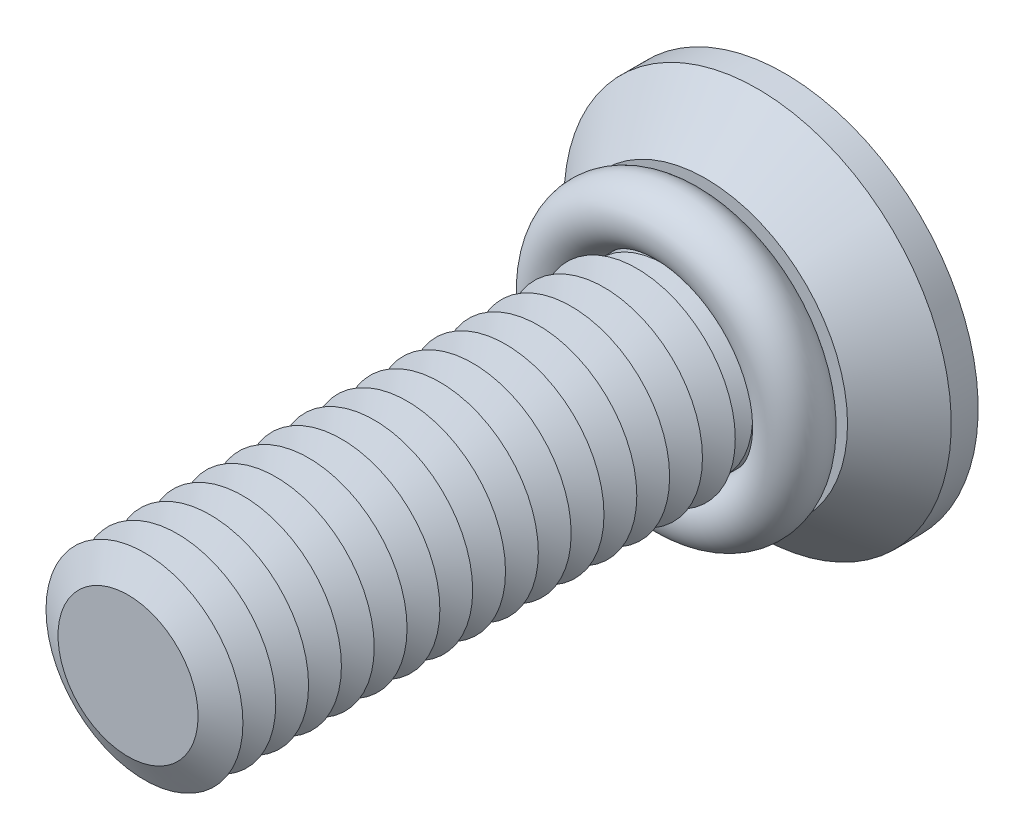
ISO-10303-21;
HEADER;
FILE_DESCRIPTION(('STEP AP214'),'2;1');
FILE_NAME('part.step','',(''),(''),'','','');
FILE_SCHEMA(('AUTOMOTIVE_DESIGN { 1 0 10303 214 1 1 1 1 }'));
ENDSEC;
DATA;
#1=APPLICATION_CONTEXT('core data for automotive mechanical design processes');
#2=APPLICATION_PROTOCOL_DEFINITION('international standard','automotive_design',2000,#1);
#3=PRODUCT_CONTEXT('',#1,'mechanical');
#4=PRODUCT('Part','Part','',(#3));
#5=PRODUCT_RELATED_PRODUCT_CATEGORY('part','',(#4));
#6=PRODUCT_DEFINITION_FORMATION('','',#4);
#7=PRODUCT_DEFINITION_CONTEXT('part definition',#1,'design');
#8=PRODUCT_DEFINITION('design','',#6,#7);
#9=PRODUCT_DEFINITION_SHAPE('','',#8);
#10=(LENGTH_UNIT() NAMED_UNIT(*) SI_UNIT(.MILLI.,.METRE.));
#11=(NAMED_UNIT(*) PLANE_ANGLE_UNIT() SI_UNIT($,.RADIAN.));
#12=(NAMED_UNIT(*) SI_UNIT($,.STERADIAN.) SOLID_ANGLE_UNIT());
#13=UNCERTAINTY_MEASURE_WITH_UNIT(LENGTH_MEASURE(1.E-05),#10,'distance_accuracy_value','');
#14=(GEOMETRIC_REPRESENTATION_CONTEXT(3) GLOBAL_UNCERTAINTY_ASSIGNED_CONTEXT((#13)) GLOBAL_UNIT_ASSIGNED_CONTEXT((#10,
#11,#12)) REPRESENTATION_CONTEXT('',''));
#15=CARTESIAN_POINT('',(0.,0.,0.));
#16=DIRECTION('',(0.,0.,1.));
#17=DIRECTION('',(1.,0.,0.));
#18=AXIS2_PLACEMENT_3D('',#15,#16,#17);
#19=CARTESIAN_POINT('',(0.,0.,3.30000000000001));
#20=DIRECTION('',(0.,0.,1.));
#21=DIRECTION('',(1.,0.,0.));
#22=AXIS2_PLACEMENT_3D('',#19,#20,#21);
#23=TOROIDAL_SURFACE('',#22,3.6,0.9);
#24=CARTESIAN_POINT('',(0.,3.6,3.30000000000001));
#25=DIRECTION('',(1.,0.,0.));
#26=DIRECTION('',(0.,0.,-1.));
#27=AXIS2_PLACEMENT_3D('',#24,#25,#26);
#28=CIRCLE('',#27,0.9);
#29=CARTESIAN_POINT('',(0.,4.5,3.30000000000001));
#30=VERTEX_POINT('',#29);
#31=EDGE_CURVE('P0_E10',#30,#30,#28,.T.);
#32=CARTESIAN_POINT('',(0.,0.,3.30000000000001));
#33=DIRECTION('',(0.,0.,1.));
#34=DIRECTION('',(1.,0.,0.));
#35=AXIS2_PLACEMENT_3D('',#32,#33,#34);
#36=CIRCLE('',#35,4.5);
#37=EDGE_CURVE('',#30,#30,#36,.T.);
#38=ORIENTED_EDGE('',*,*,#31,.F.);
#39=ORIENTED_EDGE('',*,*,#31,.T.);
#40=ORIENTED_EDGE('',*,*,#37,.T.);
#41=ORIENTED_EDGE('',*,*,#37,.F.);
#42=EDGE_LOOP('',(#38,#40,#39,#41));
#43=FACE_BOUND('',#42,.T.);
#44=ADVANCED_FACE('P0_F14',(#43),#23,.T.);
#45=CLOSED_SHELL('',(#44));
#46=MANIFOLD_SOLID_BREP('P0_B1',#45);
#47=CARTESIAN_POINT('',(0.,0.,15.));
#48=DIRECTION('',(0.,0.,-1.));
#49=DIRECTION('',(-1.,0.,0.));
#50=AXIS2_PLACEMENT_3D('',#47,#48,#49);
#51=CONICAL_SURFACE('',#50,2.13397459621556,1.0471975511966);
#52=CARTESIAN_POINT('',(0.,0.,14.5));
#53=DIRECTION('',(0.,0.,1.));
#54=DIRECTION('',(1.,0.,0.));
#55=AXIS2_PLACEMENT_3D('',#52,#53,#54);
#56=CIRCLE('',#55,3.);
#57=CARTESIAN_POINT('',(3.,0.,14.5));
#58=VERTEX_POINT('',#57);
#59=EDGE_CURVE('P1_E324',#58,#58,#56,.T.);
#60=ORIENTED_EDGE('',*,*,#59,.T.);
#61=EDGE_LOOP('',(#60));
#62=FACE_BOUND('',#61,.T.);
#63=CARTESIAN_POINT('',(0.,0.,15.));
#64=DIRECTION('',(0.,0.,1.));
#65=DIRECTION('',(1.,0.,0.));
#66=AXIS2_PLACEMENT_3D('',#63,#64,#65);
#67=CIRCLE('',#66,2.13397459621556);
#68=CARTESIAN_POINT('',(2.13397459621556,0.,15.));
#69=VERTEX_POINT('',#68);
#70=EDGE_CURVE('P1_E321',#69,#69,#67,.T.);
#71=ORIENTED_EDGE('',*,*,#70,.F.);
#72=EDGE_LOOP('',(#71));
#73=FACE_BOUND('',#72,.T.);
#74=ADVANCED_FACE('P1_F15',(#62,#73),#51,.T.);
#75=CARTESIAN_POINT('',(0.,0.,15.5));
#76=DIRECTION('',(0.,0.,1.));
#77=DIRECTION('',(1.,0.,0.));
#78=AXIS2_PLACEMENT_3D('',#75,#76,#77);
#79=CONICAL_SURFACE('',#78,3.,1.0471975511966);
#80=ORIENTED_EDGE('',*,*,#70,.T.);
#81=EDGE_LOOP('',(#80));
#82=FACE_BOUND('',#81,.T.);
#83=CARTESIAN_POINT('',(0.,0.,15.5));
#84=DIRECTION('',(0.,0.,1.));
#85=DIRECTION('',(1.,0.,0.));
#86=AXIS2_PLACEMENT_3D('',#83,#84,#85);
#87=CIRCLE('',#86,3.);
#88=CARTESIAN_POINT('',(3.,0.,15.5));
#89=VERTEX_POINT('',#88);
#90=EDGE_CURVE('P1_E318',#89,#89,#87,.T.);
#91=ORIENTED_EDGE('',*,*,#90,.F.);
#92=EDGE_LOOP('',(#91));
#93=FACE_BOUND('',#92,.T.);
#94=ADVANCED_FACE('P1_F245',(#82,#93),#79,.T.);
#95=CARTESIAN_POINT('',(0.,0.,20.));
#96=DIRECTION('',(0.,0.,1.));
#97=DIRECTION('',(1.,0.,0.));
#98=AXIS2_PLACEMENT_3D('',#95,#96,#97);
#99=PLANE('',#98);
#100=CARTESIAN_POINT('',(0.,0.,20.));
#101=DIRECTION('',(0.,0.,1.));
#102=DIRECTION('',(1.,0.,0.));
#103=AXIS2_PLACEMENT_3D('',#100,#101,#102);
#104=CIRCLE('',#103,2.13397459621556);
#105=CARTESIAN_POINT('',(2.13397459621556,0.,20.));
#106=VERTEX_POINT('',#105);
#107=EDGE_CURVE('P1_E131',#106,#106,#104,.T.);
#108=ORIENTED_EDGE('',*,*,#107,.T.);
#109=EDGE_LOOP('',(#108));
#110=FACE_BOUND('',#109,.T.);
#111=ADVANCED_FACE('P1_F251',(#110),#99,.T.);
#112=CARTESIAN_POINT('',(0.,0.,20.));
#113=DIRECTION('',(0.,0.,-1.));
#114=DIRECTION('',(-1.,0.,0.));
#115=AXIS2_PLACEMENT_3D('',#112,#113,#114);
#116=CONICAL_SURFACE('',#115,2.13397459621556,1.0471975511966);
#117=CARTESIAN_POINT('',(0.,0.,19.5));
#118=DIRECTION('',(0.,0.,1.));
#119=DIRECTION('',(1.,0.,0.));
#120=AXIS2_PLACEMENT_3D('',#117,#118,#119);
#121=CIRCLE('',#120,3.);
#122=CARTESIAN_POINT('',(3.,0.,19.5));
#123=VERTEX_POINT('',#122);
#124=EDGE_CURVE('P1_E133',#123,#123,#121,.T.);
#125=ORIENTED_EDGE('',*,*,#124,.T.);
#126=EDGE_LOOP('',(#125));
#127=FACE_BOUND('',#126,.T.);
#128=ORIENTED_EDGE('',*,*,#107,.F.);
#129=EDGE_LOOP('',(#128));
#130=FACE_BOUND('',#129,.T.);
#131=ADVANCED_FACE('P1_F196',(#127,#130),#116,.T.);
#132=CARTESIAN_POINT('',(0.,0.,19.5));
#133=DIRECTION('',(0.,0.,1.));
#134=DIRECTION('',(1.,0.,0.));
#135=AXIS2_PLACEMENT_3D('',#132,#133,#134);
#136=CONICAL_SURFACE('',#135,3.,1.0471975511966);
#137=CARTESIAN_POINT('',(0.,0.,19.));
#138=DIRECTION('',(0.,0.,1.));
#139=DIRECTION('',(1.,0.,0.));
#140=AXIS2_PLACEMENT_3D('',#137,#138,#139);
#141=CIRCLE('',#140,2.13397459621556);
#142=CARTESIAN_POINT('',(2.13397459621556,0.,19.));
#143=VERTEX_POINT('',#142);
#144=EDGE_CURVE('P1_E297',#143,#143,#141,.T.);
#145=ORIENTED_EDGE('',*,*,#144,.T.);
#146=EDGE_LOOP('',(#145));
#147=FACE_BOUND('',#146,.T.);
#148=ORIENTED_EDGE('',*,*,#124,.F.);
#149=EDGE_LOOP('',(#148));
#150=FACE_BOUND('',#149,.T.);
#151=ADVANCED_FACE('P1_F284',(#147,#150),#136,.T.);
#152=CARTESIAN_POINT('',(0.,0.,19.));
#153=DIRECTION('',(0.,0.,-1.));
#154=DIRECTION('',(-1.,0.,0.));
#155=AXIS2_PLACEMENT_3D('',#152,#153,#154);
#156=CONICAL_SURFACE('',#155,2.13397459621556,1.0471975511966);
#157=CARTESIAN_POINT('',(0.,0.,18.5));
#158=DIRECTION('',(0.,0.,1.));
#159=DIRECTION('',(1.,0.,0.));
#160=AXIS2_PLACEMENT_3D('',#157,#158,#159);
#161=CIRCLE('',#160,3.);
#162=CARTESIAN_POINT('',(3.,0.,18.5));
#163=VERTEX_POINT('',#162);
#164=EDGE_CURVE('P1_E294',#163,#163,#161,.T.);
#165=ORIENTED_EDGE('',*,*,#164,.T.);
#166=EDGE_LOOP('',(#165));
#167=FACE_BOUND('',#166,.T.);
#168=ORIENTED_EDGE('',*,*,#144,.F.);
#169=EDGE_LOOP('',(#168));
#170=FACE_BOUND('',#169,.T.);
#171=ADVANCED_FACE('P1_F279',(#167,#170),#156,.T.);
#172=CARTESIAN_POINT('',(0.,0.,18.5));
#173=DIRECTION('',(0.,0.,1.));
#174=DIRECTION('',(1.,0.,0.));
#175=AXIS2_PLACEMENT_3D('',#172,#173,#174);
#176=CONICAL_SURFACE('',#175,3.,1.0471975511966);
#177=CARTESIAN_POINT('',(0.,0.,18.));
#178=DIRECTION('',(0.,0.,1.));
#179=DIRECTION('',(1.,0.,0.));
#180=AXIS2_PLACEMENT_3D('',#177,#178,#179);
#181=CIRCLE('',#180,2.13397459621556);
#182=CARTESIAN_POINT('',(2.13397459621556,0.,18.));
#183=VERTEX_POINT('',#182);
#184=EDGE_CURVE('P1_E301',#183,#183,#181,.T.);
#185=ORIENTED_EDGE('',*,*,#184,.T.);
#186=EDGE_LOOP('',(#185));
#187=FACE_BOUND('',#186,.T.);
#188=ORIENTED_EDGE('',*,*,#164,.F.);
#189=EDGE_LOOP('',(#188));
#190=FACE_BOUND('',#189,.T.);
#191=ADVANCED_FACE('P1_F276',(#187,#190),#176,.T.);
#192=CARTESIAN_POINT('',(0.,0.,18.));
#193=DIRECTION('',(0.,0.,-1.));
#194=DIRECTION('',(-1.,0.,0.));
#195=AXIS2_PLACEMENT_3D('',#192,#193,#194);
#196=CONICAL_SURFACE('',#195,2.13397459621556,1.0471975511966);
#197=CARTESIAN_POINT('',(0.,0.,17.5));
#198=DIRECTION('',(0.,0.,1.));
#199=DIRECTION('',(1.,0.,0.));
#200=AXIS2_PLACEMENT_3D('',#197,#198,#199);
#201=CIRCLE('',#200,3.);
#202=CARTESIAN_POINT('',(3.,0.,17.5));
#203=VERTEX_POINT('',#202);
#204=EDGE_CURVE('P1_E306',#203,#203,#201,.T.);
#205=ORIENTED_EDGE('',*,*,#204,.T.);
#206=EDGE_LOOP('',(#205));
#207=FACE_BOUND('',#206,.T.);
#208=ORIENTED_EDGE('',*,*,#184,.F.);
#209=EDGE_LOOP('',(#208));
#210=FACE_BOUND('',#209,.T.);
#211=ADVANCED_FACE('P1_F271',(#207,#210),#196,.T.);
#212=CARTESIAN_POINT('',(0.,0.,17.5));
#213=DIRECTION('',(0.,0.,1.));
#214=DIRECTION('',(1.,0.,0.));
#215=AXIS2_PLACEMENT_3D('',#212,#213,#214);
#216=CONICAL_SURFACE('',#215,3.,1.0471975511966);
#217=CARTESIAN_POINT('',(0.,0.,17.));
#218=DIRECTION('',(0.,0.,1.));
#219=DIRECTION('',(1.,0.,0.));
#220=AXIS2_PLACEMENT_3D('',#217,#218,#219);
#221=CIRCLE('',#220,2.13397459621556);
#222=CARTESIAN_POINT('',(2.13397459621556,0.,17.));
#223=VERTEX_POINT('',#222);
#224=EDGE_CURVE('P1_E309',#223,#223,#221,.T.);
#225=ORIENTED_EDGE('',*,*,#224,.T.);
#226=EDGE_LOOP('',(#225));
#227=FACE_BOUND('',#226,.T.);
#228=ORIENTED_EDGE('',*,*,#204,.F.);
#229=EDGE_LOOP('',(#228));
#230=FACE_BOUND('',#229,.T.);
#231=ADVANCED_FACE('P1_F268',(#227,#230),#216,.T.);
#232=CARTESIAN_POINT('',(0.,0.,17.));
#233=DIRECTION('',(0.,0.,-1.));
#234=DIRECTION('',(-1.,0.,0.));
#235=AXIS2_PLACEMENT_3D('',#232,#233,#234);
#236=CONICAL_SURFACE('',#235,2.13397459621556,1.0471975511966);
#237=CARTESIAN_POINT('',(0.,0.,16.5));
#238=DIRECTION('',(0.,0.,1.));
#239=DIRECTION('',(1.,0.,0.));
#240=AXIS2_PLACEMENT_3D('',#237,#238,#239);
#241=CIRCLE('',#240,3.);
#242=CARTESIAN_POINT('',(3.,0.,16.5));
#243=VERTEX_POINT('',#242);
#244=EDGE_CURVE('P1_E312',#243,#243,#241,.T.);
#245=ORIENTED_EDGE('',*,*,#244,.T.);
#246=EDGE_LOOP('',(#245));
#247=FACE_BOUND('',#246,.T.);
#248=ORIENTED_EDGE('',*,*,#224,.F.);
#249=EDGE_LOOP('',(#248));
#250=FACE_BOUND('',#249,.T.);
#251=ADVANCED_FACE('P1_F262',(#247,#250),#236,.T.);
#252=CARTESIAN_POINT('',(0.,0.,16.5));
#253=DIRECTION('',(0.,0.,1.));
#254=DIRECTION('',(1.,0.,0.));
#255=AXIS2_PLACEMENT_3D('',#252,#253,#254);
#256=CONICAL_SURFACE('',#255,3.,1.0471975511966);
#257=CARTESIAN_POINT('',(0.,0.,16.));
#258=DIRECTION('',(0.,0.,1.));
#259=DIRECTION('',(1.,0.,0.));
#260=AXIS2_PLACEMENT_3D('',#257,#258,#259);
#261=CIRCLE('',#260,2.13397459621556);
#262=CARTESIAN_POINT('',(2.13397459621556,0.,16.));
#263=VERTEX_POINT('',#262);
#264=EDGE_CURVE('P1_E315',#263,#263,#261,.T.);
#265=ORIENTED_EDGE('',*,*,#264,.T.);
#266=EDGE_LOOP('',(#265));
#267=FACE_BOUND('',#266,.T.);
#268=ORIENTED_EDGE('',*,*,#244,.F.);
#269=EDGE_LOOP('',(#268));
#270=FACE_BOUND('',#269,.T.);
#271=ADVANCED_FACE('P1_F258',(#267,#270),#256,.T.);
#272=CARTESIAN_POINT('',(0.,0.,16.));
#273=DIRECTION('',(0.,0.,-1.));
#274=DIRECTION('',(-1.,0.,0.));
#275=AXIS2_PLACEMENT_3D('',#272,#273,#274);
#276=CONICAL_SURFACE('',#275,2.13397459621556,1.0471975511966);
#277=ORIENTED_EDGE('',*,*,#90,.T.);
#278=EDGE_LOOP('',(#277));
#279=FACE_BOUND('',#278,.T.);
#280=ORIENTED_EDGE('',*,*,#264,.F.);
#281=EDGE_LOOP('',(#280));
#282=FACE_BOUND('',#281,.T.);
#283=ADVANCED_FACE('P1_F261',(#279,#282),#276,.T.);
#284=CARTESIAN_POINT('',(0.,0.,14.));
#285=DIRECTION('',(0.,0.,-1.));
#286=DIRECTION('',(-1.,0.,0.));
#287=AXIS2_PLACEMENT_3D('',#284,#285,#286);
#288=CONICAL_SURFACE('',#287,2.13397459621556,1.0471975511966);
#289=CARTESIAN_POINT('',(0.,0.,13.5));
#290=DIRECTION('',(0.,0.,1.));
#291=DIRECTION('',(1.,0.,0.));
#292=AXIS2_PLACEMENT_3D('',#289,#290,#291);
#293=CIRCLE('',#292,3.);
#294=CARTESIAN_POINT('',(3.,0.,13.5));
#295=VERTEX_POINT('',#294);
#296=EDGE_CURVE('P1_E329',#295,#295,#293,.T.);
#297=ORIENTED_EDGE('',*,*,#296,.T.);
#298=EDGE_LOOP('',(#297));
#299=FACE_BOUND('',#298,.T.);
#300=CARTESIAN_POINT('',(0.,0.,14.));
#301=DIRECTION('',(0.,0.,1.));
#302=DIRECTION('',(1.,0.,0.));
#303=AXIS2_PLACEMENT_3D('',#300,#301,#302);
#304=CIRCLE('',#303,2.13397459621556);
#305=CARTESIAN_POINT('',(2.13397459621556,0.,14.));
#306=VERTEX_POINT('',#305);
#307=EDGE_CURVE('P1_E326',#306,#306,#304,.T.);
#308=ORIENTED_EDGE('',*,*,#307,.F.);
#309=EDGE_LOOP('',(#308));
#310=FACE_BOUND('',#309,.T.);
#311=ADVANCED_FACE('P1_F266',(#299,#310),#288,.T.);
#312=CARTESIAN_POINT('',(0.,0.,14.5));
#313=DIRECTION('',(0.,0.,1.));
#314=DIRECTION('',(1.,0.,0.));
#315=AXIS2_PLACEMENT_3D('',#312,#313,#314);
#316=CONICAL_SURFACE('',#315,3.,1.0471975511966);
#317=ORIENTED_EDGE('',*,*,#307,.T.);
#318=EDGE_LOOP('',(#317));
#319=FACE_BOUND('',#318,.T.);
#320=ORIENTED_EDGE('',*,*,#59,.F.);
#321=EDGE_LOOP('',(#320));
#322=FACE_BOUND('',#321,.T.);
#323=ADVANCED_FACE('P1_F492',(#319,#322),#316,.T.);
#324=CARTESIAN_POINT('',(0.,0.,13.));
#325=DIRECTION('',(0.,0.,-1.));
#326=DIRECTION('',(-1.,0.,0.));
#327=AXIS2_PLACEMENT_3D('',#324,#325,#326);
#328=CONICAL_SURFACE('',#327,2.13397459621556,1.0471975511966);
#329=CARTESIAN_POINT('',(0.,0.,12.5));
#330=DIRECTION('',(0.,0.,1.));
#331=DIRECTION('',(1.,0.,0.));
#332=AXIS2_PLACEMENT_3D('',#329,#330,#331);
#333=CIRCLE('',#332,3.);
#334=CARTESIAN_POINT('',(3.,0.,12.5));
#335=VERTEX_POINT('',#334);
#336=EDGE_CURVE('P1_E335',#335,#335,#333,.T.);
#337=ORIENTED_EDGE('',*,*,#336,.T.);
#338=EDGE_LOOP('',(#337));
#339=FACE_BOUND('',#338,.T.);
#340=CARTESIAN_POINT('',(0.,0.,13.));
#341=DIRECTION('',(0.,0.,1.));
#342=DIRECTION('',(1.,0.,0.));
#343=AXIS2_PLACEMENT_3D('',#340,#341,#342);
#344=CIRCLE('',#343,2.13397459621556);
#345=CARTESIAN_POINT('',(2.13397459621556,0.,13.));
#346=VERTEX_POINT('',#345);
#347=EDGE_CURVE('P1_E332',#346,#346,#344,.T.);
#348=ORIENTED_EDGE('',*,*,#347,.F.);
#349=EDGE_LOOP('',(#348));
#350=FACE_BOUND('',#349,.T.);
#351=ADVANCED_FACE('P1_F502',(#339,#350),#328,.T.);
#352=CARTESIAN_POINT('',(0.,0.,13.5));
#353=DIRECTION('',(0.,0.,1.));
#354=DIRECTION('',(1.,0.,0.));
#355=AXIS2_PLACEMENT_3D('',#352,#353,#354);
#356=CONICAL_SURFACE('',#355,3.,1.0471975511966);
#357=ORIENTED_EDGE('',*,*,#347,.T.);
#358=EDGE_LOOP('',(#357));
#359=FACE_BOUND('',#358,.T.);
#360=ORIENTED_EDGE('',*,*,#296,.F.);
#361=EDGE_LOOP('',(#360));
#362=FACE_BOUND('',#361,.T.);
#363=ADVANCED_FACE('P1_F512',(#359,#362),#356,.T.);
#364=CARTESIAN_POINT('',(0.,0.,12.));
#365=DIRECTION('',(0.,0.,-1.));
#366=DIRECTION('',(-1.,0.,0.));
#367=AXIS2_PLACEMENT_3D('',#364,#365,#366);
#368=CONICAL_SURFACE('',#367,2.13397459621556,1.0471975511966);
#369=CARTESIAN_POINT('',(0.,0.,11.5));
#370=DIRECTION('',(0.,0.,1.));
#371=DIRECTION('',(1.,0.,0.));
#372=AXIS2_PLACEMENT_3D('',#369,#370,#371);
#373=CIRCLE('',#372,3.);
#374=CARTESIAN_POINT('',(3.,0.,11.5));
#375=VERTEX_POINT('',#374);
#376=EDGE_CURVE('P1_E341',#375,#375,#373,.T.);
#377=ORIENTED_EDGE('',*,*,#376,.T.);
#378=EDGE_LOOP('',(#377));
#379=FACE_BOUND('',#378,.T.);
#380=CARTESIAN_POINT('',(0.,0.,12.));
#381=DIRECTION('',(0.,0.,1.));
#382=DIRECTION('',(1.,0.,0.));
#383=AXIS2_PLACEMENT_3D('',#380,#381,#382);
#384=CIRCLE('',#383,2.13397459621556);
#385=CARTESIAN_POINT('',(2.13397459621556,0.,12.));
#386=VERTEX_POINT('',#385);
#387=EDGE_CURVE('P1_E338',#386,#386,#384,.T.);
#388=ORIENTED_EDGE('',*,*,#387,.F.);
#389=EDGE_LOOP('',(#388));
#390=FACE_BOUND('',#389,.T.);
#391=ADVANCED_FACE('P1_F522',(#379,#390),#368,.T.);
#392=CARTESIAN_POINT('',(0.,0.,12.5));
#393=DIRECTION('',(0.,0.,1.));
#394=DIRECTION('',(1.,0.,0.));
#395=AXIS2_PLACEMENT_3D('',#392,#393,#394);
#396=CONICAL_SURFACE('',#395,3.,1.0471975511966);
#397=ORIENTED_EDGE('',*,*,#387,.T.);
#398=EDGE_LOOP('',(#397));
#399=FACE_BOUND('',#398,.T.);
#400=ORIENTED_EDGE('',*,*,#336,.F.);
#401=EDGE_LOOP('',(#400));
#402=FACE_BOUND('',#401,.T.);
#403=ADVANCED_FACE('P1_F532',(#399,#402),#396,.T.);
#404=CARTESIAN_POINT('',(0.,0.,11.));
#405=DIRECTION('',(0.,0.,-1.));
#406=DIRECTION('',(-1.,0.,0.));
#407=AXIS2_PLACEMENT_3D('',#404,#405,#406);
#408=CONICAL_SURFACE('',#407,2.13397459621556,1.0471975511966);
#409=CARTESIAN_POINT('',(0.,0.,10.5));
#410=DIRECTION('',(0.,0.,1.));
#411=DIRECTION('',(1.,0.,0.));
#412=AXIS2_PLACEMENT_3D('',#409,#410,#411);
#413=CIRCLE('',#412,3.);
#414=CARTESIAN_POINT('',(3.,0.,10.5));
#415=VERTEX_POINT('',#414);
#416=EDGE_CURVE('P1_E347',#415,#415,#413,.T.);
#417=ORIENTED_EDGE('',*,*,#416,.T.);
#418=EDGE_LOOP('',(#417));
#419=FACE_BOUND('',#418,.T.);
#420=CARTESIAN_POINT('',(0.,0.,11.));
#421=DIRECTION('',(0.,0.,1.));
#422=DIRECTION('',(1.,0.,0.));
#423=AXIS2_PLACEMENT_3D('',#420,#421,#422);
#424=CIRCLE('',#423,2.13397459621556);
#425=CARTESIAN_POINT('',(2.13397459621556,0.,11.));
#426=VERTEX_POINT('',#425);
#427=EDGE_CURVE('P1_E344',#426,#426,#424,.T.);
#428=ORIENTED_EDGE('',*,*,#427,.F.);
#429=EDGE_LOOP('',(#428));
#430=FACE_BOUND('',#429,.T.);
#431=ADVANCED_FACE('P1_F542',(#419,#430),#408,.T.);
#432=CARTESIAN_POINT('',(0.,0.,11.5));
#433=DIRECTION('',(0.,0.,1.));
#434=DIRECTION('',(1.,0.,0.));
#435=AXIS2_PLACEMENT_3D('',#432,#433,#434);
#436=CONICAL_SURFACE('',#435,3.,1.0471975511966);
#437=ORIENTED_EDGE('',*,*,#427,.T.);
#438=EDGE_LOOP('',(#437));
#439=FACE_BOUND('',#438,.T.);
#440=ORIENTED_EDGE('',*,*,#376,.F.);
#441=EDGE_LOOP('',(#440));
#442=FACE_BOUND('',#441,.T.);
#443=ADVANCED_FACE('P1_F552',(#439,#442),#436,.T.);
#444=CARTESIAN_POINT('',(0.,0.,10.));
#445=DIRECTION('',(0.,0.,-1.));
#446=DIRECTION('',(-1.,0.,0.));
#447=AXIS2_PLACEMENT_3D('',#444,#445,#446);
#448=CONICAL_SURFACE('',#447,2.13397459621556,1.0471975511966);
#449=CARTESIAN_POINT('',(0.,0.,9.5));
#450=DIRECTION('',(0.,0.,1.));
#451=DIRECTION('',(1.,0.,0.));
#452=AXIS2_PLACEMENT_3D('',#449,#450,#451);
#453=CIRCLE('',#452,3.);
#454=CARTESIAN_POINT('',(3.,0.,9.5));
#455=VERTEX_POINT('',#454);
#456=EDGE_CURVE('P1_E353',#455,#455,#453,.T.);
#457=ORIENTED_EDGE('',*,*,#456,.T.);
#458=EDGE_LOOP('',(#457));
#459=FACE_BOUND('',#458,.T.);
#460=CARTESIAN_POINT('',(0.,0.,10.));
#461=DIRECTION('',(0.,0.,1.));
#462=DIRECTION('',(1.,0.,0.));
#463=AXIS2_PLACEMENT_3D('',#460,#461,#462);
#464=CIRCLE('',#463,2.13397459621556);
#465=CARTESIAN_POINT('',(2.13397459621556,0.,10.));
#466=VERTEX_POINT('',#465);
#467=EDGE_CURVE('P1_E350',#466,#466,#464,.T.);
#468=ORIENTED_EDGE('',*,*,#467,.F.);
#469=EDGE_LOOP('',(#468));
#470=FACE_BOUND('',#469,.T.);
#471=ADVANCED_FACE('P1_F562',(#459,#470),#448,.T.);
#472=CARTESIAN_POINT('',(0.,0.,10.5));
#473=DIRECTION('',(0.,0.,1.));
#474=DIRECTION('',(1.,0.,0.));
#475=AXIS2_PLACEMENT_3D('',#472,#473,#474);
#476=CONICAL_SURFACE('',#475,3.,1.0471975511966);
#477=ORIENTED_EDGE('',*,*,#467,.T.);
#478=EDGE_LOOP('',(#477));
#479=FACE_BOUND('',#478,.T.);
#480=ORIENTED_EDGE('',*,*,#416,.F.);
#481=EDGE_LOOP('',(#480));
#482=FACE_BOUND('',#481,.T.);
#483=ADVANCED_FACE('P1_F572',(#479,#482),#476,.T.);
#484=CARTESIAN_POINT('',(0.,0.,9.));
#485=DIRECTION('',(0.,0.,-1.));
#486=DIRECTION('',(-1.,0.,0.));
#487=AXIS2_PLACEMENT_3D('',#484,#485,#486);
#488=CONICAL_SURFACE('',#487,2.13397459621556,1.0471975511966);
#489=CARTESIAN_POINT('',(0.,0.,8.5));
#490=DIRECTION('',(0.,0.,1.));
#491=DIRECTION('',(1.,0.,0.));
#492=AXIS2_PLACEMENT_3D('',#489,#490,#491);
#493=CIRCLE('',#492,3.);
#494=CARTESIAN_POINT('',(3.,0.,8.5));
#495=VERTEX_POINT('',#494);
#496=EDGE_CURVE('P1_E359',#495,#495,#493,.T.);
#497=ORIENTED_EDGE('',*,*,#496,.T.);
#498=EDGE_LOOP('',(#497));
#499=FACE_BOUND('',#498,.T.);
#500=CARTESIAN_POINT('',(0.,0.,9.));
#501=DIRECTION('',(0.,0.,1.));
#502=DIRECTION('',(1.,0.,0.));
#503=AXIS2_PLACEMENT_3D('',#500,#501,#502);
#504=CIRCLE('',#503,2.13397459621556);
#505=CARTESIAN_POINT('',(2.13397459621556,0.,9.));
#506=VERTEX_POINT('',#505);
#507=EDGE_CURVE('P1_E356',#506,#506,#504,.T.);
#508=ORIENTED_EDGE('',*,*,#507,.F.);
#509=EDGE_LOOP('',(#508));
#510=FACE_BOUND('',#509,.T.);
#511=ADVANCED_FACE('P1_F582',(#499,#510),#488,.T.);
#512=CARTESIAN_POINT('',(0.,0.,9.5));
#513=DIRECTION('',(0.,0.,1.));
#514=DIRECTION('',(1.,0.,0.));
#515=AXIS2_PLACEMENT_3D('',#512,#513,#514);
#516=CONICAL_SURFACE('',#515,3.,1.0471975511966);
#517=ORIENTED_EDGE('',*,*,#507,.T.);
#518=EDGE_LOOP('',(#517));
#519=FACE_BOUND('',#518,.T.);
#520=ORIENTED_EDGE('',*,*,#456,.F.);
#521=EDGE_LOOP('',(#520));
#522=FACE_BOUND('',#521,.T.);
#523=ADVANCED_FACE('P1_F592',(#519,#522),#516,.T.);
#524=CARTESIAN_POINT('',(0.,0.,8.));
#525=DIRECTION('',(0.,0.,-1.));
#526=DIRECTION('',(-1.,0.,0.));
#527=AXIS2_PLACEMENT_3D('',#524,#525,#526);
#528=CONICAL_SURFACE('',#527,2.13397459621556,1.0471975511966);
#529=CARTESIAN_POINT('',(0.,0.,7.5));
#530=DIRECTION('',(0.,0.,1.));
#531=DIRECTION('',(1.,0.,0.));
#532=AXIS2_PLACEMENT_3D('',#529,#530,#531);
#533=CIRCLE('',#532,3.);
#534=CARTESIAN_POINT('',(3.,0.,7.5));
#535=VERTEX_POINT('',#534);
#536=EDGE_CURVE('P1_E365',#535,#535,#533,.T.);
#537=ORIENTED_EDGE('',*,*,#536,.T.);
#538=EDGE_LOOP('',(#537));
#539=FACE_BOUND('',#538,.T.);
#540=CARTESIAN_POINT('',(0.,0.,8.));
#541=DIRECTION('',(0.,0.,1.));
#542=DIRECTION('',(1.,0.,0.));
#543=AXIS2_PLACEMENT_3D('',#540,#541,#542);
#544=CIRCLE('',#543,2.13397459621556);
#545=CARTESIAN_POINT('',(2.13397459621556,0.,8.));
#546=VERTEX_POINT('',#545);
#547=EDGE_CURVE('P1_E362',#546,#546,#544,.T.);
#548=ORIENTED_EDGE('',*,*,#547,.F.);
#549=EDGE_LOOP('',(#548));
#550=FACE_BOUND('',#549,.T.);
#551=ADVANCED_FACE('P1_F602',(#539,#550),#528,.T.);
#552=CARTESIAN_POINT('',(0.,0.,8.5));
#553=DIRECTION('',(0.,0.,1.));
#554=DIRECTION('',(1.,0.,0.));
#555=AXIS2_PLACEMENT_3D('',#552,#553,#554);
#556=CONICAL_SURFACE('',#555,3.,1.0471975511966);
#557=ORIENTED_EDGE('',*,*,#547,.T.);
#558=EDGE_LOOP('',(#557));
#559=FACE_BOUND('',#558,.T.);
#560=ORIENTED_EDGE('',*,*,#496,.F.);
#561=EDGE_LOOP('',(#560));
#562=FACE_BOUND('',#561,.T.);
#563=ADVANCED_FACE('P1_F612',(#559,#562),#556,.T.);
#564=CARTESIAN_POINT('',(0.,0.,7.));
#565=DIRECTION('',(0.,0.,-1.));
#566=DIRECTION('',(-1.,0.,0.));
#567=AXIS2_PLACEMENT_3D('',#564,#565,#566);
#568=CONICAL_SURFACE('',#567,2.13397459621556,1.0471975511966);
#569=CARTESIAN_POINT('',(0.,0.,6.5));
#570=DIRECTION('',(0.,0.,1.));
#571=DIRECTION('',(1.,0.,0.));
#572=AXIS2_PLACEMENT_3D('',#569,#570,#571);
#573=CIRCLE('',#572,3.);
#574=CARTESIAN_POINT('',(3.,0.,6.5));
#575=VERTEX_POINT('',#574);
#576=EDGE_CURVE('P1_E371',#575,#575,#573,.T.);
#577=ORIENTED_EDGE('',*,*,#576,.T.);
#578=EDGE_LOOP('',(#577));
#579=FACE_BOUND('',#578,.T.);
#580=CARTESIAN_POINT('',(0.,0.,7.));
#581=DIRECTION('',(0.,0.,1.));
#582=DIRECTION('',(1.,0.,0.));
#583=AXIS2_PLACEMENT_3D('',#580,#581,#582);
#584=CIRCLE('',#583,2.13397459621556);
#585=CARTESIAN_POINT('',(2.13397459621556,0.,7.));
#586=VERTEX_POINT('',#585);
#587=EDGE_CURVE('P1_E368',#586,#586,#584,.T.);
#588=ORIENTED_EDGE('',*,*,#587,.F.);
#589=EDGE_LOOP('',(#588));
#590=FACE_BOUND('',#589,.T.);
#591=ADVANCED_FACE('P1_F622',(#579,#590),#568,.T.);
#592=CARTESIAN_POINT('',(0.,0.,7.5));
#593=DIRECTION('',(0.,0.,1.));
#594=DIRECTION('',(1.,0.,0.));
#595=AXIS2_PLACEMENT_3D('',#592,#593,#594);
#596=CONICAL_SURFACE('',#595,3.,1.0471975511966);
#597=ORIENTED_EDGE('',*,*,#587,.T.);
#598=EDGE_LOOP('',(#597));
#599=FACE_BOUND('',#598,.T.);
#600=ORIENTED_EDGE('',*,*,#536,.F.);
#601=EDGE_LOOP('',(#600));
#602=FACE_BOUND('',#601,.T.);
#603=ADVANCED_FACE('P1_F632',(#599,#602),#596,.T.);
#604=CARTESIAN_POINT('',(0.,0.,6.));
#605=DIRECTION('',(0.,0.,-1.));
#606=DIRECTION('',(-1.,0.,0.));
#607=AXIS2_PLACEMENT_3D('',#604,#605,#606);
#608=CONICAL_SURFACE('',#607,2.13397459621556,1.0471975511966);
#609=CARTESIAN_POINT('',(0.,0.,5.5));
#610=DIRECTION('',(0.,0.,1.));
#611=DIRECTION('',(1.,0.,0.));
#612=AXIS2_PLACEMENT_3D('',#609,#610,#611);
#613=CIRCLE('',#612,3.);
#614=CARTESIAN_POINT('',(3.,0.,5.5));
#615=VERTEX_POINT('',#614);
#616=EDGE_CURVE('P1_E377',#615,#615,#613,.T.);
#617=ORIENTED_EDGE('',*,*,#616,.T.);
#618=EDGE_LOOP('',(#617));
#619=FACE_BOUND('',#618,.T.);
#620=CARTESIAN_POINT('',(0.,0.,6.));
#621=DIRECTION('',(0.,0.,1.));
#622=DIRECTION('',(1.,0.,0.));
#623=AXIS2_PLACEMENT_3D('',#620,#621,#622);
#624=CIRCLE('',#623,2.13397459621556);
#625=CARTESIAN_POINT('',(2.13397459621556,0.,6.));
#626=VERTEX_POINT('',#625);
#627=EDGE_CURVE('P1_E374',#626,#626,#624,.T.);
#628=ORIENTED_EDGE('',*,*,#627,.F.);
#629=EDGE_LOOP('',(#628));
#630=FACE_BOUND('',#629,.T.);
#631=ADVANCED_FACE('P1_F642',(#619,#630),#608,.T.);
#632=CARTESIAN_POINT('',(0.,0.,6.5));
#633=DIRECTION('',(0.,0.,1.));
#634=DIRECTION('',(1.,0.,0.));
#635=AXIS2_PLACEMENT_3D('',#632,#633,#634);
#636=CONICAL_SURFACE('',#635,3.,1.0471975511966);
#637=ORIENTED_EDGE('',*,*,#627,.T.);
#638=EDGE_LOOP('',(#637));
#639=FACE_BOUND('',#638,.T.);
#640=ORIENTED_EDGE('',*,*,#576,.F.);
#641=EDGE_LOOP('',(#640));
#642=FACE_BOUND('',#641,.T.);
#643=ADVANCED_FACE('P1_F652',(#639,#642),#636,.T.);
#644=CARTESIAN_POINT('',(0.,0.,5.));
#645=DIRECTION('',(0.,0.,-1.));
#646=DIRECTION('',(-1.,0.,0.));
#647=AXIS2_PLACEMENT_3D('',#644,#645,#646);
#648=CONICAL_SURFACE('',#647,2.13397459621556,1.0471975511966);
#649=CARTESIAN_POINT('',(0.,0.,4.5));
#650=DIRECTION('',(0.,0.,1.));
#651=DIRECTION('',(1.,0.,0.));
#652=AXIS2_PLACEMENT_3D('',#649,#650,#651);
#653=CIRCLE('',#652,3.);
#654=CARTESIAN_POINT('',(3.,0.,4.5));
#655=VERTEX_POINT('',#654);
#656=EDGE_CURVE('P1_E383',#655,#655,#653,.T.);
#657=ORIENTED_EDGE('',*,*,#656,.T.);
#658=EDGE_LOOP('',(#657));
#659=FACE_BOUND('',#658,.T.);
#660=CARTESIAN_POINT('',(0.,0.,5.));
#661=DIRECTION('',(0.,0.,1.));
#662=DIRECTION('',(1.,0.,0.));
#663=AXIS2_PLACEMENT_3D('',#660,#661,#662);
#664=CIRCLE('',#663,2.13397459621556);
#665=CARTESIAN_POINT('',(2.13397459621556,0.,5.));
#666=VERTEX_POINT('',#665);
#667=EDGE_CURVE('P1_E380',#666,#666,#664,.T.);
#668=ORIENTED_EDGE('',*,*,#667,.F.);
#669=EDGE_LOOP('',(#668));
#670=FACE_BOUND('',#669,.T.);
#671=ADVANCED_FACE('P1_F662',(#659,#670),#648,.T.);
#672=CARTESIAN_POINT('',(0.,0.,5.5));
#673=DIRECTION('',(0.,0.,1.));
#674=DIRECTION('',(1.,0.,0.));
#675=AXIS2_PLACEMENT_3D('',#672,#673,#674);
#676=CONICAL_SURFACE('',#675,3.,1.0471975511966);
#677=ORIENTED_EDGE('',*,*,#667,.T.);
#678=EDGE_LOOP('',(#677));
#679=FACE_BOUND('',#678,.T.);
#680=ORIENTED_EDGE('',*,*,#616,.F.);
#681=EDGE_LOOP('',(#680));
#682=FACE_BOUND('',#681,.T.);
#683=ADVANCED_FACE('P1_F396',(#679,#682),#676,.T.);
#684=CARTESIAN_POINT('',(0.,0.,4.));
#685=DIRECTION('',(0.,0.,-1.));
#686=DIRECTION('',(-1.,0.,0.));
#687=AXIS2_PLACEMENT_3D('',#684,#685,#686);
#688=CONICAL_SURFACE('',#687,2.13397459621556,1.0471975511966);
#689=CARTESIAN_POINT('',(0.,0.,4.));
#690=DIRECTION('',(0.,0.,1.));
#691=DIRECTION('',(1.,0.,0.));
#692=AXIS2_PLACEMENT_3D('',#689,#690,#691);
#693=CIRCLE('',#692,2.13397459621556);
#694=CARTESIAN_POINT('',(2.13397459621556,0.,4.));
#695=VERTEX_POINT('',#694);
#696=EDGE_CURVE('P1_E386',#695,#695,#693,.T.);
#697=ORIENTED_EDGE('',*,*,#696,.F.);
#698=EDGE_LOOP('',(#697));
#699=FACE_BOUND('',#698,.T.);
#700=CARTESIAN_POINT('',(0.,0.,3.67320508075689));
#701=DIRECTION('',(0.,0.,-1.));
#702=DIRECTION('',(-1.,0.,0.));
#703=AXIS2_PLACEMENT_3D('',#700,#701,#702);
#704=CIRCLE('',#703,2.7);
#705=CARTESIAN_POINT('',(-2.7,0.,3.67320508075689));
#706=VERTEX_POINT('',#705);
#707=EDGE_CURVE('P1_E19',#706,#706,#704,.F.);
#708=ORIENTED_EDGE('',*,*,#707,.T.);
#709=EDGE_LOOP('',(#708));
#710=FACE_BOUND('',#709,.T.);
#711=ADVANCED_FACE('P1_F393',(#699,#710),#688,.T.);
#712=CARTESIAN_POINT('',(0.,0.,4.5));
#713=DIRECTION('',(0.,0.,1.));
#714=DIRECTION('',(1.,0.,0.));
#715=AXIS2_PLACEMENT_3D('',#712,#713,#714);
#716=CONICAL_SURFACE('',#715,3.,1.0471975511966);
#717=ORIENTED_EDGE('',*,*,#696,.T.);
#718=EDGE_LOOP('',(#717));
#719=FACE_BOUND('',#718,.T.);
#720=ORIENTED_EDGE('',*,*,#656,.F.);
#721=EDGE_LOOP('',(#720));
#722=FACE_BOUND('',#721,.T.);
#723=ADVANCED_FACE('P1_F390',(#719,#722),#716,.T.);
#724=CARTESIAN_POINT('',(0.,0.,2.5));
#725=DIRECTION('',(0.,0.,-1.));
#726=DIRECTION('',(-1.,0.,0.));
#727=AXIS2_PLACEMENT_3D('',#724,#725,#726);
#728=CONICAL_SURFACE('',#727,2.,1.0471975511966);
#729=CARTESIAN_POINT('',(0.,0.,3.65470053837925));
#730=VERTEX_POINT('',#729);
#731=VERTEX_LOOP('',#730);
#732=FACE_BOUND('',#731,.T.);
#733=CARTESIAN_POINT('',(0.,0.,2.5));
#734=DIRECTION('',(0.,0.,-1.));
#735=DIRECTION('',(-1.,0.,0.));
#736=AXIS2_PLACEMENT_3D('',#733,#734,#735);
#737=CIRCLE('',#736,2.);
#738=CARTESIAN_POINT('',(-2.,0.,2.5));
#739=VERTEX_POINT('',#738);
#740=CARTESIAN_POINT('',(-1.,1.73205080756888,2.5));
#741=VERTEX_POINT('',#740);
#742=EDGE_CURVE('P1_E117',#739,#741,#737,.T.);
#743=ORIENTED_EDGE('',*,*,#742,.T.);
#744=CARTESIAN_POINT('',(0.,0.,2.5));
#745=DIRECTION('',(0.,0.,-1.));
#746=DIRECTION('',(-1.,0.,0.));
#747=AXIS2_PLACEMENT_3D('',#744,#745,#746);
#748=CIRCLE('',#747,2.);
#749=CARTESIAN_POINT('',(1.,1.73205080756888,2.5));
#750=VERTEX_POINT('',#749);
#751=EDGE_CURVE('P1_E24',#741,#750,#748,.T.);
#752=ORIENTED_EDGE('',*,*,#751,.T.);
#753=CARTESIAN_POINT('',(2.,0.,2.5));
#754=VERTEX_POINT('',#753);
#755=EDGE_CURVE('P1_E895',#750,#754,#748,.T.);
#756=ORIENTED_EDGE('',*,*,#755,.T.);
#757=CARTESIAN_POINT('',(1.,-1.73205080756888,2.5));
#758=VERTEX_POINT('',#757);
#759=EDGE_CURVE('P1_E888',#754,#758,#748,.T.);
#760=ORIENTED_EDGE('',*,*,#759,.T.);
#761=CARTESIAN_POINT('',(-0.999999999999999,-1.73205080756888,2.5));
#762=VERTEX_POINT('',#761);
#763=EDGE_CURVE('P1_E182',#758,#762,#748,.T.);
#764=ORIENTED_EDGE('',*,*,#763,.T.);
#765=EDGE_CURVE('P1_E179',#762,#739,#748,.T.);
#766=ORIENTED_EDGE('',*,*,#765,.T.);
#767=EDGE_LOOP('',(#743,#752,#756,#760,#764,#766));
#768=FACE_BOUND('',#767,.T.);
#769=ADVANCED_FACE('P1_F198',(#732,#768),#728,.F.);
#770=CARTESIAN_POINT('',(0.,0.,2.5));
#771=DIRECTION('',(0.,0.,-1.));
#772=DIRECTION('',(-1.,0.,0.));
#773=AXIS2_PLACEMENT_3D('',#770,#771,#772);
#774=PLANE('',#773);
#775=ORIENTED_EDGE('',*,*,#763,.F.);
#776=DIRECTION('',(-0.866025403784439,-0.5,0.));
#777=VECTOR('',#776,1.);
#778=CARTESIAN_POINT('',(2.,-1.15470053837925,2.5));
#779=LINE('',#778,#777);
#780=CARTESIAN_POINT('',(0.,-2.3094010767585,2.5));
#781=VERTEX_POINT('',#780);
#782=EDGE_CURVE('P1_E904',#758,#781,#779,.T.);
#783=ORIENTED_EDGE('',*,*,#782,.T.);
#784=DIRECTION('',(-0.866025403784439,0.5,0.));
#785=VECTOR('',#784,1.);
#786=CARTESIAN_POINT('',(0.,-2.3094010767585,2.5));
#787=LINE('',#786,#785);
#788=EDGE_CURVE('P1_E911',#781,#762,#787,.T.);
#789=ORIENTED_EDGE('',*,*,#788,.T.);
#790=EDGE_LOOP('',(#775,#783,#789));
#791=FACE_BOUND('',#790,.T.);
#792=ADVANCED_FACE('P1_F704',(#791),#774,.T.);
#793=ORIENTED_EDGE('',*,*,#765,.F.);
#794=CARTESIAN_POINT('',(-2.,-1.15470053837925,2.5));
#795=VERTEX_POINT('',#794);
#796=EDGE_CURVE('P1_E914',#762,#795,#787,.T.);
#797=ORIENTED_EDGE('',*,*,#796,.T.);
#798=DIRECTION('',(0.,1.,0.));
#799=VECTOR('',#798,1.);
#800=CARTESIAN_POINT('',(-2.,-1.15470053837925,2.5));
#801=LINE('',#800,#799);
#802=EDGE_CURVE('P1_E123',#795,#739,#801,.T.);
#803=ORIENTED_EDGE('',*,*,#802,.T.);
#804=EDGE_LOOP('',(#793,#797,#803));
#805=FACE_BOUND('',#804,.T.);
#806=ADVANCED_FACE('P1_F231',(#805),#774,.T.);
#807=ORIENTED_EDGE('',*,*,#742,.F.);
#808=CARTESIAN_POINT('',(-2.,1.15470053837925,2.5));
#809=VERTEX_POINT('',#808);
#810=EDGE_CURVE('P1_E916',#739,#809,#801,.T.);
#811=ORIENTED_EDGE('',*,*,#810,.T.);
#812=DIRECTION('',(0.866025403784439,0.5,0.));
#813=VECTOR('',#812,1.);
#814=CARTESIAN_POINT('',(-2.,1.15470053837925,2.5));
#815=LINE('',#814,#813);
#816=EDGE_CURVE('P1_E919',#809,#741,#815,.T.);
#817=ORIENTED_EDGE('',*,*,#816,.T.);
#818=EDGE_LOOP('',(#807,#811,#817));
#819=FACE_BOUND('',#818,.T.);
#820=ADVANCED_FACE('P1_F721',(#819),#774,.T.);
#821=ORIENTED_EDGE('',*,*,#751,.F.);
#822=CARTESIAN_POINT('',(0.,2.3094010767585,2.5));
#823=VERTEX_POINT('',#822);
#824=EDGE_CURVE('P1_E918',#741,#823,#815,.T.);
#825=ORIENTED_EDGE('',*,*,#824,.T.);
#826=DIRECTION('',(0.866025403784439,-0.5,0.));
#827=VECTOR('',#826,1.);
#828=CARTESIAN_POINT('',(0.,2.3094010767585,2.5));
#829=LINE('',#828,#827);
#830=EDGE_CURVE('P1_E161',#823,#750,#829,.T.);
#831=ORIENTED_EDGE('',*,*,#830,.T.);
#832=EDGE_LOOP('',(#821,#825,#831));
#833=FACE_BOUND('',#832,.T.);
#834=ADVANCED_FACE('P1_F730',(#833),#774,.T.);
#835=ORIENTED_EDGE('',*,*,#755,.F.);
#836=CARTESIAN_POINT('',(2.,1.15470053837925,2.5));
#837=VERTEX_POINT('',#836);
#838=EDGE_CURVE('P1_E903',#750,#837,#829,.T.);
#839=ORIENTED_EDGE('',*,*,#838,.T.);
#840=DIRECTION('',(0.,-1.,0.));
#841=VECTOR('',#840,1.);
#842=CARTESIAN_POINT('',(2.,1.15470053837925,2.5));
#843=LINE('',#842,#841);
#844=EDGE_CURVE('P1_E898',#837,#754,#843,.T.);
#845=ORIENTED_EDGE('',*,*,#844,.T.);
#846=EDGE_LOOP('',(#835,#839,#845));
#847=FACE_BOUND('',#846,.T.);
#848=ADVANCED_FACE('P1_F739',(#847),#774,.T.);
#849=ORIENTED_EDGE('',*,*,#759,.F.);
#850=CARTESIAN_POINT('',(2.,-1.15470053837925,2.5));
#851=VERTEX_POINT('',#850);
#852=EDGE_CURVE('P1_E890',#754,#851,#843,.T.);
#853=ORIENTED_EDGE('',*,*,#852,.T.);
#854=EDGE_CURVE('P1_E125',#851,#758,#779,.T.);
#855=ORIENTED_EDGE('',*,*,#854,.T.);
#856=EDGE_LOOP('',(#849,#853,#855));
#857=FACE_BOUND('',#856,.T.);
#858=ADVANCED_FACE('P1_F229',(#857),#774,.T.);
#859=CARTESIAN_POINT('',(2.,-1.15470053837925,2.5));
#860=DIRECTION('',(0.5,-0.866025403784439,0.));
#861=DIRECTION('',(0.866025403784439,0.5,0.));
#862=AXIS2_PLACEMENT_3D('',#859,#860,#861);
#863=PLANE('',#862);
#864=DIRECTION('',(0.,0.,-1.));
#865=VECTOR('',#864,1.);
#866=CARTESIAN_POINT('',(2.,-1.15470053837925,2.5));
#867=LINE('',#866,#865);
#868=CARTESIAN_POINT('',(2.,-1.15470053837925,0.));
#869=VERTEX_POINT('',#868);
#870=EDGE_CURVE('P1_E164',#851,#869,#867,.T.);
#871=ORIENTED_EDGE('',*,*,#870,.T.);
#872=CARTESIAN_POINT('',(2.0002,-1.15458506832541,-3.09424280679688E-05));
#873=CARTESIAN_POINT('',(1.91712847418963,-1.20254643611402,0.0128270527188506));
#874=CARTESIAN_POINT('',(1.83390630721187,-1.25059477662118,0.0245000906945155));
#875=CARTESIAN_POINT('',(1.66716800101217,-1.34686118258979,0.0450086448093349));
#876=CARTESIAN_POINT('',(1.58365175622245,-1.39507930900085,0.0538430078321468));
#877=CARTESIAN_POINT('',(1.41683177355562,-1.49139287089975,0.0681583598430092));
#878=CARTESIAN_POINT('',(1.33352916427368,-1.53948765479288,0.0736564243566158));
#879=CARTESIAN_POINT('',(1.1668176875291,-1.63573857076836,0.0810287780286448));
#880=CARTESIAN_POINT('',(1.08340884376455,-1.68389468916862,0.0829037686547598));
#881=CARTESIAN_POINT('',(0.916591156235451,-1.78020692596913,0.0829037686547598));
#882=CARTESIAN_POINT('',(0.833182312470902,-1.82836304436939,0.0810287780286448));
#883=CARTESIAN_POINT('',(0.666470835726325,-1.92461396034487,0.0736564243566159));
#884=CARTESIAN_POINT('',(0.583168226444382,-1.972708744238,0.0681583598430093));
#885=CARTESIAN_POINT('',(0.416348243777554,-2.0690223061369,0.0538430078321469));
#886=CARTESIAN_POINT('',(0.332831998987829,-2.11724043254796,0.045008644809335));
#887=CARTESIAN_POINT('',(0.16609369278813,-2.21350683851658,0.0245000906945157));
#888=CARTESIAN_POINT('',(0.0828715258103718,-2.26155517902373,0.0128270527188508));
#889=CARTESIAN_POINT('',(-0.000199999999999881,-2.30951654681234,-3.09424280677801E-05));
#890=B_SPLINE_CURVE_WITH_KNOTS('',3,(#872,#873,#874,#875,#876,#877,#878,#879,#880,#881,#882,
#883,#884,#885,#886,#887,#888,#889),.UNSPECIFIED.,.F.,.F.,(4,2,2,2,2,2,2,2,4),(0.,
0.29035724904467,0.580832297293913,0.869807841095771,1.15872743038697,1.44764701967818,
1.73662256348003,2.02709761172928,2.31745486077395),.UNSPECIFIED.);
#891=CARTESIAN_POINT('',(0.,-2.3094010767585,0.));
#892=VERTEX_POINT('',#891);
#893=EDGE_CURVE('P1_E118',#869,#892,#890,.T.);
#894=ORIENTED_EDGE('',*,*,#893,.T.);
#895=DIRECTION('',(0.,0.,-1.));
#896=VECTOR('',#895,1.);
#897=CARTESIAN_POINT('',(0.,-2.3094010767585,2.5));
#898=LINE('',#897,#896);
#899=EDGE_CURVE('P1_E116',#781,#892,#898,.T.);
#900=ORIENTED_EDGE('',*,*,#899,.F.);
#901=ORIENTED_EDGE('',*,*,#782,.F.);
#902=ORIENTED_EDGE('',*,*,#854,.F.);
#903=EDGE_LOOP('',(#871,#894,#900,#901,#902));
#904=FACE_BOUND('',#903,.T.);
#905=ADVANCED_FACE('P1_F226',(#904),#863,.F.);
#906=CARTESIAN_POINT('',(0.,-2.3094010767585,2.5));
#907=DIRECTION('',(-0.5,-0.866025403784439,0.));
#908=DIRECTION('',(0.866025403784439,-0.5,0.));
#909=AXIS2_PLACEMENT_3D('',#906,#907,#908);
#910=PLANE('',#909);
#911=ORIENTED_EDGE('',*,*,#899,.T.);
#912=CARTESIAN_POINT('',(0.00019999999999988,-2.30951654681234,-3.09424280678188E-05));
#913=CARTESIAN_POINT('',(-0.0828715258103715,-2.26155517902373,0.0128270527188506));
#914=CARTESIAN_POINT('',(-0.166093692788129,-2.21350683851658,0.0245000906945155));
#915=CARTESIAN_POINT('',(-0.332831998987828,-2.11724043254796,0.0450086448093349));
#916=CARTESIAN_POINT('',(-0.416348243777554,-2.0690223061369,0.0538430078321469));
#917=CARTESIAN_POINT('',(-0.583168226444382,-1.972708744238,0.0681583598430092));
#918=CARTESIAN_POINT('',(-0.666470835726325,-1.92461396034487,0.0736564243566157));
#919=CARTESIAN_POINT('',(-0.833182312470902,-1.82836304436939,0.0810287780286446));
#920=CARTESIAN_POINT('',(-0.916591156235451,-1.78020692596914,0.0829037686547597));
#921=CARTESIAN_POINT('',(-1.08340884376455,-1.68389468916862,0.0829037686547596));
#922=CARTESIAN_POINT('',(-1.1668176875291,-1.63573857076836,0.0810287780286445));
#923=CARTESIAN_POINT('',(-1.33352916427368,-1.53948765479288,0.0736564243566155));
#924=CARTESIAN_POINT('',(-1.41683177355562,-1.49139287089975,0.068158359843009));
#925=CARTESIAN_POINT('',(-1.58365175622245,-1.39507930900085,0.0538430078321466));
#926=CARTESIAN_POINT('',(-1.66716800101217,-1.3468611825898,0.0450086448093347));
#927=CARTESIAN_POINT('',(-1.83390630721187,-1.25059477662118,0.0245000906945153));
#928=CARTESIAN_POINT('',(-1.91712847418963,-1.20254643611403,0.0128270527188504));
#929=CARTESIAN_POINT('',(-2.0002,-1.15458506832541,-3.09424280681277E-05));
#930=B_SPLINE_CURVE_WITH_KNOTS('',3,(#912,#913,#914,#915,#916,#917,#918,#919,#920,#921,#922,
#923,#924,#925,#926,#927,#928,#929),.UNSPECIFIED.,.F.,.F.,(4,2,2,2,2,2,2,2,4),(0.,
0.29035724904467,0.580832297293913,0.86980784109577,1.15872743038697,1.44764701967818,
1.73662256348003,2.02709761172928,2.31745486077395),.UNSPECIFIED.);
#931=CARTESIAN_POINT('',(-2.,-1.15470053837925,0.));
#932=VERTEX_POINT('',#931);
#933=EDGE_CURVE('P1_E94',#892,#932,#930,.T.);
#934=ORIENTED_EDGE('',*,*,#933,.T.);
#935=DIRECTION('',(0.,0.,-1.));
#936=VECTOR('',#935,1.);
#937=CARTESIAN_POINT('',(-2.,-1.15470053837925,2.5));
#938=LINE('',#937,#936);
#939=EDGE_CURVE('P1_E112',#795,#932,#938,.T.);
#940=ORIENTED_EDGE('',*,*,#939,.F.);
#941=ORIENTED_EDGE('',*,*,#796,.F.);
#942=ORIENTED_EDGE('',*,*,#788,.F.);
#943=EDGE_LOOP('',(#911,#934,#940,#941,#942));
#944=FACE_BOUND('',#943,.T.);
#945=ADVANCED_FACE('P1_F110',(#944),#910,.F.);
#946=CARTESIAN_POINT('',(-2.,-1.15470053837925,2.5));
#947=DIRECTION('',(-1.,0.,0.));
#948=DIRECTION('',(0.,0.,1.));
#949=AXIS2_PLACEMENT_3D('',#946,#947,#948);
#950=PLANE('',#949);
#951=ORIENTED_EDGE('',*,*,#939,.T.);
#952=CARTESIAN_POINT('',(-2.,-3.01440758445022,-0.350516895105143));
#953=CARTESIAN_POINT('',(-2.,-2.92409762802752,-0.330356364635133));
#954=CARTESIAN_POINT('',(-2.,-2.83373054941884,-0.31045254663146));
#955=CARTESIAN_POINT('',(-2.,-2.65285291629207,-0.271288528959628));
#956=CARTESIAN_POINT('',(-2.,-2.562342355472,-0.252028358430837));
#957=CARTESIAN_POINT('',(-2.,-2.29037985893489,-0.195373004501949));
#958=CARTESIAN_POINT('',(-2.,-2.10868043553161,-0.159144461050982));
#959=CARTESIAN_POINT('',(-2.,-1.74597297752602,-0.091716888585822));
#960=CARTESIAN_POINT('',(-2.,-1.56497266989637,-0.0604768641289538));
#961=CARTESIAN_POINT('',(-2.,-1.20186568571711,-0.00513826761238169));
#962=CARTESIAN_POINT('',(-2.,-1.01975924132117,0.0189617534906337));
#963=CARTESIAN_POINT('',(-2.,-0.744747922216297,0.0474098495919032));
#964=CARTESIAN_POINT('',(-2.,-0.652245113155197,0.0556328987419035));
#965=CARTESIAN_POINT('',(-2.,-0.467020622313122,0.0690059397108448));
#966=CARTESIAN_POINT('',(-2.,-0.374298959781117,0.074156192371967));
#967=CARTESIAN_POINT('',(-2.,-0.188764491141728,0.0810845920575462));
#968=CARTESIAN_POINT('',(-2.,-0.0959517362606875,0.0828640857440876));
#969=CARTESIAN_POINT('',(-2.,0.0896753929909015,0.0829421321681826));
#970=CARTESIAN_POINT('',(-2.,0.182489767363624,0.0812406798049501));
#971=CARTESIAN_POINT('',(-2.,0.368369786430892,0.0744510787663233));
#972=CARTESIAN_POINT('',(-2.,0.461434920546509,0.0693492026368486));
#973=CARTESIAN_POINT('',(-2.,0.647346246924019,0.0560433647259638));
#974=CARTESIAN_POINT('',(-2.,0.740192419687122,0.0478391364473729));
#975=CARTESIAN_POINT('',(-2.,1.01841374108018,0.0191822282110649));
#976=CARTESIAN_POINT('',(-2.,1.2033713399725,-0.00531018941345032));
#977=CARTESIAN_POINT('',(-2.,1.57694396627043,-0.0623620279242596));
#978=CARTESIAN_POINT('',(-2.,1.76552771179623,-0.095116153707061));
#979=CARTESIAN_POINT('',(-2.,2.14178491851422,-0.165570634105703));
#980=CARTESIAN_POINT('',(-2.,2.32945822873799,-0.203271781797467));
#981=CARTESIAN_POINT('',(-2.,2.70417911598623,-0.28188312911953));
#982=CARTESIAN_POINT('',(-2.,2.89122649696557,-0.322794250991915));
#983=CARTESIAN_POINT('',(-2.,3.26484478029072,-0.406742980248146));
#984=CARTESIAN_POINT('',(-2.,3.45141567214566,-0.449780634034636));
#985=CARTESIAN_POINT('',(-2.,3.821938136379,-0.536781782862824));
#986=CARTESIAN_POINT('',(-2.,4.00589388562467,-0.580727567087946));
#987=CARTESIAN_POINT('',(-2.,4.37356350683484,-0.669635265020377));
#988=CARTESIAN_POINT('',(-2.,4.55727737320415,-0.714597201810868));
#989=CARTESIAN_POINT('',(-2.,4.9242660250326,-0.805198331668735));
#990=CARTESIAN_POINT('',(-2.,5.10754106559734,-0.85083649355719));
#991=CARTESIAN_POINT('',(-2.,5.47394280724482,-0.942676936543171));
#992=CARTESIAN_POINT('',(-2.,5.65706951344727,-0.988879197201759));
#993=CARTESIAN_POINT('',(-2.,5.84014583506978,-1.03527803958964));
#994=B_SPLINE_CURVE_WITH_KNOTS('',3,(#952,#953,#954,#955,#956,#957,#958,#959,#960,#961,#962,
#963,#964,#965,#966,#967,#968,#969,#970,#971,#972,#973,#974,#975,#976,#977,#978,#979,#980,#981,
#982,#983,#984,#985,#986,#987,#988,#989,#990,#991,#992,#993),.UNSPECIFIED.,.F.,.F.,(4,2,2,2,2,2,
2,2,2,2,2,2,2,2,2,2,2,2,2,2,4),(0.,0.277597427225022,0.555207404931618,1.11099118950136,
1.66194208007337,2.21278108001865,2.49134108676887,2.76987744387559,3.04830249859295,
3.32672796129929,3.60628428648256,3.88586463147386,4.44532615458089,5.01945893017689,
5.59368385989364,6.16807437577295,6.74247743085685,7.30986991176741,7.87727529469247,
8.44388991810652,9.01048407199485),.UNSPECIFIED.);
#995=CARTESIAN_POINT('',(-2.,1.15470053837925,0.));
#996=VERTEX_POINT('',#995);
#997=EDGE_CURVE('P1_E10',#932,#996,#994,.T.);
#998=ORIENTED_EDGE('',*,*,#997,.T.);
#999=DIRECTION('',(0.,0.,-1.));
#1000=VECTOR('',#999,1.);
#1001=CARTESIAN_POINT('',(-2.,1.15470053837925,2.5));
#1002=LINE('',#1001,#1000);
#1003=EDGE_CURVE('P1_E124',#809,#996,#1002,.T.);
#1004=ORIENTED_EDGE('',*,*,#1003,.F.);
#1005=ORIENTED_EDGE('',*,*,#810,.F.);
#1006=ORIENTED_EDGE('',*,*,#802,.F.);
#1007=EDGE_LOOP('',(#951,#998,#1004,#1005,#1006));
#1008=FACE_BOUND('',#1007,.T.);
#1009=ADVANCED_FACE('P1_F120',(#1008),#950,.F.);
#1010=CARTESIAN_POINT('',(-2.,1.15470053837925,2.5));
#1011=DIRECTION('',(-0.5,0.866025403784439,0.));
#1012=DIRECTION('',(-0.866025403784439,-0.5,0.));
#1013=AXIS2_PLACEMENT_3D('',#1010,#1011,#1012);
#1014=PLANE('',#1013);
#1015=ORIENTED_EDGE('',*,*,#1003,.T.);
#1016=CARTESIAN_POINT('',(-2.0002,1.15458506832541,-3.09424280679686E-05));
#1017=CARTESIAN_POINT('',(-1.91712847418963,1.20254643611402,0.0128270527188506));
#1018=CARTESIAN_POINT('',(-1.83390630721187,1.25059477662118,0.0245000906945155));
#1019=CARTESIAN_POINT('',(-1.66716800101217,1.3468611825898,0.0450086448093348));
#1020=CARTESIAN_POINT('',(-1.58365175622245,1.39507930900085,0.0538430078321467));
#1021=CARTESIAN_POINT('',(-1.41683177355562,1.49139287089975,0.0681583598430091));
#1022=CARTESIAN_POINT('',(-1.33352916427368,1.53948765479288,0.0736564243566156));
#1023=CARTESIAN_POINT('',(-1.1668176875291,1.63573857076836,0.0810287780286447));
#1024=CARTESIAN_POINT('',(-1.08340884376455,1.68389468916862,0.0829037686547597));
#1025=CARTESIAN_POINT('',(-0.916591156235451,1.78020692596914,0.0829037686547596));
#1026=CARTESIAN_POINT('',(-0.833182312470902,1.82836304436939,0.0810287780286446));
#1027=CARTESIAN_POINT('',(-0.666470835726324,1.92461396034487,0.0736564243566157));
#1028=CARTESIAN_POINT('',(-0.583168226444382,1.972708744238,0.0681583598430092));
#1029=CARTESIAN_POINT('',(-0.416348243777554,2.0690223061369,0.0538430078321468));
#1030=CARTESIAN_POINT('',(-0.332831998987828,2.11724043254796,0.0450086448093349));
#1031=CARTESIAN_POINT('',(-0.16609369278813,2.21350683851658,0.0245000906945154));
#1032=CARTESIAN_POINT('',(-0.0828715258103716,2.26155517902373,0.0128270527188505));
#1033=CARTESIAN_POINT('',(0.000199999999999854,2.30951654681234,-3.09424280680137E-05));
#1034=B_SPLINE_CURVE_WITH_KNOTS('',3,(#1016,#1017,#1018,#1019,#1020,#1021,#1022,#1023,#1024,
#1025,#1026,#1027,#1028,#1029,#1030,#1031,#1032,#1033),.UNSPECIFIED.,.F.,.F.,(4,2,2,2,2,2,2,2,
4),(0.,0.290357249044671,0.580832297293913,0.86980784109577,1.15872743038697,1.44764701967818,
1.73662256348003,2.02709761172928,2.31745486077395),.UNSPECIFIED.);
#1035=CARTESIAN_POINT('',(0.,2.3094010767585,0.));
#1036=VERTEX_POINT('',#1035);
#1037=EDGE_CURVE('P1_E136',#996,#1036,#1034,.T.);
#1038=ORIENTED_EDGE('',*,*,#1037,.T.);
#1039=DIRECTION('',(0.,0.,-1.));
#1040=VECTOR('',#1039,1.);
#1041=CARTESIAN_POINT('',(0.,2.3094010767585,2.5));
#1042=LINE('',#1041,#1040);
#1043=EDGE_CURVE('P1_E155',#823,#1036,#1042,.T.);
#1044=ORIENTED_EDGE('',*,*,#1043,.F.);
#1045=ORIENTED_EDGE('',*,*,#824,.F.);
#1046=ORIENTED_EDGE('',*,*,#816,.F.);
#1047=EDGE_LOOP('',(#1015,#1038,#1044,#1045,#1046));
#1048=FACE_BOUND('',#1047,.T.);
#1049=ADVANCED_FACE('P1_F153',(#1048),#1014,.F.);
#1050=CARTESIAN_POINT('',(0.,2.3094010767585,2.5));
#1051=DIRECTION('',(0.5,0.866025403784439,0.));
#1052=DIRECTION('',(-0.866025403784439,0.5,0.));
#1053=AXIS2_PLACEMENT_3D('',#1050,#1051,#1052);
#1054=PLANE('',#1053);
#1055=ORIENTED_EDGE('',*,*,#1043,.T.);
#1056=CARTESIAN_POINT('',(-0.000200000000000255,2.30951654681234,-3.09424280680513E-05));
#1057=CARTESIAN_POINT('',(0.0828715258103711,2.26155517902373,0.0128270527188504));
#1058=CARTESIAN_POINT('',(0.166093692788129,2.21350683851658,0.0245000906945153));
#1059=CARTESIAN_POINT('',(0.332831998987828,2.11724043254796,0.0450086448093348));
#1060=CARTESIAN_POINT('',(0.416348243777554,2.0690223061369,0.0538430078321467));
#1061=CARTESIAN_POINT('',(0.583168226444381,1.972708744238,0.0681583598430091));
#1062=CARTESIAN_POINT('',(0.666470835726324,1.92461396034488,0.0736564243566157));
#1063=CARTESIAN_POINT('',(0.833182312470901,1.82836304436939,0.0810287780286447));
#1064=CARTESIAN_POINT('',(0.916591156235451,1.78020692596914,0.0829037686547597));
#1065=CARTESIAN_POINT('',(1.08340884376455,1.68389468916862,0.0829037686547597));
#1066=CARTESIAN_POINT('',(1.1668176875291,1.63573857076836,0.0810287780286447));
#1067=CARTESIAN_POINT('',(1.33352916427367,1.53948765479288,0.0736564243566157));
#1068=CARTESIAN_POINT('',(1.41683177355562,1.49139287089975,0.0681583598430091));
#1069=CARTESIAN_POINT('',(1.58365175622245,1.39507930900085,0.0538430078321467));
#1070=CARTESIAN_POINT('',(1.66716800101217,1.3468611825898,0.0450086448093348));
#1071=CARTESIAN_POINT('',(1.83390630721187,1.25059477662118,0.0245000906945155));
#1072=CARTESIAN_POINT('',(1.91712847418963,1.20254643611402,0.0128270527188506));
#1073=CARTESIAN_POINT('',(2.0002,1.15458506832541,-3.09424280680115E-05));
#1074=B_SPLINE_CURVE_WITH_KNOTS('',3,(#1056,#1057,#1058,#1059,#1060,#1061,#1062,#1063,#1064,
#1065,#1066,#1067,#1068,#1069,#1070,#1071,#1072,#1073),.UNSPECIFIED.,.F.,.F.,(4,2,2,2,2,2,2,2,
4),(0.,0.290357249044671,0.580832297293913,0.869807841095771,1.15872743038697,1.44764701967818,
1.73662256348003,2.02709761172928,2.31745486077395),.UNSPECIFIED.);
#1075=CARTESIAN_POINT('',(2.,1.15470053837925,0.));
#1076=VERTEX_POINT('',#1075);
#1077=EDGE_CURVE('P1_E141',#1036,#1076,#1074,.T.);
#1078=ORIENTED_EDGE('',*,*,#1077,.T.);
#1079=DIRECTION('',(0.,0.,-1.));
#1080=VECTOR('',#1079,1.);
#1081=CARTESIAN_POINT('',(2.,1.15470053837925,2.5));
#1082=LINE('',#1081,#1080);
#1083=EDGE_CURVE('P1_E162',#837,#1076,#1082,.T.);
#1084=ORIENTED_EDGE('',*,*,#1083,.F.);
#1085=ORIENTED_EDGE('',*,*,#838,.F.);
#1086=ORIENTED_EDGE('',*,*,#830,.F.);
#1087=EDGE_LOOP('',(#1055,#1078,#1084,#1085,#1086));
#1088=FACE_BOUND('',#1087,.T.);
#1089=ADVANCED_FACE('P1_F158',(#1088),#1054,.F.);
#1090=CARTESIAN_POINT('',(2.,1.15470053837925,2.5));
#1091=DIRECTION('',(1.,0.,0.));
#1092=DIRECTION('',(0.,0.,-1.));
#1093=AXIS2_PLACEMENT_3D('',#1090,#1091,#1092);
#1094=PLANE('',#1093);
#1095=ORIENTED_EDGE('',*,*,#1083,.T.);
#1096=CARTESIAN_POINT('',(2.,-3.01440758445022,-0.350516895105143));
#1097=CARTESIAN_POINT('',(2.,-2.92409762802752,-0.330356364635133));
#1098=CARTESIAN_POINT('',(2.,-2.83373054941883,-0.31045254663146));
#1099=CARTESIAN_POINT('',(2.,-2.65285291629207,-0.271288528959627));
#1100=CARTESIAN_POINT('',(2.,-2.562342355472,-0.252028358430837));
#1101=CARTESIAN_POINT('',(2.,-2.29037985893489,-0.195373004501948));
#1102=CARTESIAN_POINT('',(2.,-2.10868043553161,-0.159144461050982));
#1103=CARTESIAN_POINT('',(2.,-1.74597297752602,-0.0917168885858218));
#1104=CARTESIAN_POINT('',(2.,-1.56497266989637,-0.0604768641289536));
#1105=CARTESIAN_POINT('',(2.,-1.20186568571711,-0.00513826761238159));
#1106=CARTESIAN_POINT('',(2.,-1.01975924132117,0.0189617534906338));
#1107=CARTESIAN_POINT('',(2.,-0.744747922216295,0.0474098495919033));
#1108=CARTESIAN_POINT('',(2.,-0.652245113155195,0.0556328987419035));
#1109=CARTESIAN_POINT('',(2.,-0.46702062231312,0.0690059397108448));
#1110=CARTESIAN_POINT('',(2.,-0.374298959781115,0.0741561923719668));
#1111=CARTESIAN_POINT('',(2.,-0.188764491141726,0.0810845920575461));
#1112=CARTESIAN_POINT('',(2.,-0.0959517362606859,0.0828640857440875));
#1113=CARTESIAN_POINT('',(2.,0.0896753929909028,0.0829421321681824));
#1114=CARTESIAN_POINT('',(2.,0.182489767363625,0.0812406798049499));
#1115=CARTESIAN_POINT('',(2.,0.368369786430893,0.074451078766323));
#1116=CARTESIAN_POINT('',(2.,0.461434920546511,0.0693492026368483));
#1117=CARTESIAN_POINT('',(2.,0.647346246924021,0.0560433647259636));
#1118=CARTESIAN_POINT('',(2.,0.740192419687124,0.0478391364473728));
#1119=CARTESIAN_POINT('',(2.,1.01841374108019,0.0191822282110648));
#1120=CARTESIAN_POINT('',(2.,1.2033713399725,-0.00531018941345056));
#1121=CARTESIAN_POINT('',(2.,1.57694396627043,-0.06236202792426));
#1122=CARTESIAN_POINT('',(2.,1.76552771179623,-0.0951161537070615));
#1123=CARTESIAN_POINT('',(2.,2.14178491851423,-0.165570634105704));
#1124=CARTESIAN_POINT('',(2.,2.32945822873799,-0.203271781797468));
#1125=CARTESIAN_POINT('',(2.,2.70417911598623,-0.281883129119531));
#1126=CARTESIAN_POINT('',(2.,2.89122649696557,-0.322794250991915));
#1127=CARTESIAN_POINT('',(2.,3.26484478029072,-0.406742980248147));
#1128=CARTESIAN_POINT('',(2.,3.45141567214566,-0.449780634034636));
#1129=CARTESIAN_POINT('',(2.,3.821938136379,-0.536781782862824));
#1130=CARTESIAN_POINT('',(2.,4.00589388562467,-0.580727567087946));
#1131=CARTESIAN_POINT('',(2.,4.37356350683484,-0.669635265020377));
#1132=CARTESIAN_POINT('',(2.,4.55727737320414,-0.714597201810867));
#1133=CARTESIAN_POINT('',(2.,4.92426602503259,-0.805198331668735));
#1134=CARTESIAN_POINT('',(2.,5.10754106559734,-0.850836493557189));
#1135=CARTESIAN_POINT('',(2.,5.47394280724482,-0.942676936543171));
#1136=CARTESIAN_POINT('',(2.,5.65706951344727,-0.988879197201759));
#1137=CARTESIAN_POINT('',(2.,5.84014583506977,-1.03527803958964));
#1138=B_SPLINE_CURVE_WITH_KNOTS('',3,(#1096,#1097,#1098,#1099,#1100,#1101,#1102,#1103,#1104,
#1105,#1106,#1107,#1108,#1109,#1110,#1111,#1112,#1113,#1114,#1115,#1116,#1117,#1118,#1119,#1120,
#1121,#1122,#1123,#1124,#1125,#1126,#1127,#1128,#1129,#1130,#1131,#1132,#1133,#1134,#1135,#1136,
#1137),.UNSPECIFIED.,.F.,.F.,(4,2,2,2,2,2,2,2,2,2,2,2,2,2,2,2,2,2,2,2,4),(0.,0.277597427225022,
0.555207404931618,1.11099118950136,1.66194208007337,2.21278108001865,2.49134108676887,
2.76987744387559,3.04830249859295,3.32672796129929,3.60628428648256,3.88586463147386,
4.44532615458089,5.01945893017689,5.59368385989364,6.16807437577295,6.74247743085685,
7.30986991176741,7.87727529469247,8.44388991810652,9.01048407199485),.UNSPECIFIED.);
#1139=EDGE_CURVE('P1_E149',#1076,#869,#1138,.F.);
#1140=ORIENTED_EDGE('',*,*,#1139,.T.);
#1141=ORIENTED_EDGE('',*,*,#870,.F.);
#1142=ORIENTED_EDGE('',*,*,#852,.F.);
#1143=ORIENTED_EDGE('',*,*,#844,.F.);
#1144=EDGE_LOOP('',(#1095,#1140,#1141,#1142,#1143));
#1145=FACE_BOUND('',#1144,.T.);
#1146=ADVANCED_FACE('P1_F232',(#1145),#1094,.F.);
#1147=CARTESIAN_POINT('',(0.,0.,0.));
#1148=DIRECTION('',(0.,0.,-1.));
#1149=DIRECTION('',(-1.,0.,0.));
#1150=AXIS2_PLACEMENT_3D('',#1147,#1148,#1149);
#1151=CONICAL_SURFACE('',#1150,2.3094010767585,1.30899693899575);
#1152=CARTESIAN_POINT('',(0.,0.,0.));
#1153=DIRECTION('',(0.,0.,-1.));
#1154=DIRECTION('',(-1.,0.,0.));
#1155=AXIS2_PLACEMENT_3D('',#1152,#1153,#1154);
#1156=CIRCLE('',#1155,2.3094010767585);
#1157=EDGE_CURVE('P1_E30',#869,#892,#1156,.T.);
#1158=ORIENTED_EDGE('',*,*,#1157,.T.);
#1159=ORIENTED_EDGE('',*,*,#893,.F.);
#1160=EDGE_LOOP('',(#1158,#1159));
#1161=FACE_BOUND('',#1160,.T.);
#1162=ADVANCED_FACE('P1_F195',(#1161),#1151,.F.);
#1163=EDGE_CURVE('P1_E90',#892,#932,#1156,.T.);
#1164=ORIENTED_EDGE('',*,*,#1163,.T.);
#1165=ORIENTED_EDGE('',*,*,#933,.F.);
#1166=EDGE_LOOP('',(#1164,#1165));
#1167=FACE_BOUND('',#1166,.T.);
#1168=ADVANCED_FACE('P1_F92',(#1167),#1151,.F.);
#1169=EDGE_CURVE('P1_E98',#932,#996,#1156,.T.);
#1170=ORIENTED_EDGE('',*,*,#1169,.T.);
#1171=ORIENTED_EDGE('',*,*,#997,.F.);
#1172=EDGE_LOOP('',(#1170,#1171));
#1173=FACE_BOUND('',#1172,.T.);
#1174=ADVANCED_FACE('P1_F102',(#1173),#1151,.F.);
#1175=EDGE_CURVE('P1_E130',#996,#1036,#1156,.T.);
#1176=ORIENTED_EDGE('',*,*,#1175,.T.);
#1177=ORIENTED_EDGE('',*,*,#1037,.F.);
#1178=EDGE_LOOP('',(#1176,#1177));
#1179=FACE_BOUND('',#1178,.T.);
#1180=ADVANCED_FACE('P1_F814',(#1179),#1151,.F.);
#1181=EDGE_CURVE('P1_E137',#1036,#1076,#1156,.T.);
#1182=ORIENTED_EDGE('',*,*,#1181,.T.);
#1183=ORIENTED_EDGE('',*,*,#1077,.F.);
#1184=EDGE_LOOP('',(#1182,#1183));
#1185=FACE_BOUND('',#1184,.T.);
#1186=ADVANCED_FACE('P1_F144',(#1185),#1151,.F.);
#1187=EDGE_CURVE('P1_E37',#1076,#869,#1156,.T.);
#1188=ORIENTED_EDGE('',*,*,#1187,.T.);
#1189=ORIENTED_EDGE('',*,*,#1139,.F.);
#1190=EDGE_LOOP('',(#1188,#1189));
#1191=FACE_BOUND('',#1190,.T.);
#1192=ADVANCED_FACE('P1_F801',(#1191),#1151,.F.);
#1193=CARTESIAN_POINT('',(0.,0.,0.));
#1194=DIRECTION('',(0.,0.,1.));
#1195=DIRECTION('',(1.,0.,0.));
#1196=AXIS2_PLACEMENT_3D('',#1193,#1194,#1195);
#1197=PLANE('',#1196);
#1198=ORIENTED_EDGE('',*,*,#1187,.F.);
#1199=ORIENTED_EDGE('',*,*,#1181,.F.);
#1200=ORIENTED_EDGE('',*,*,#1175,.F.);
#1201=ORIENTED_EDGE('',*,*,#1169,.F.);
#1202=ORIENTED_EDGE('',*,*,#1163,.F.);
#1203=ORIENTED_EDGE('',*,*,#1157,.F.);
#1204=EDGE_LOOP('',(#1198,#1199,#1200,#1201,#1202,#1203));
#1205=FACE_BOUND('',#1204,.T.);
#1206=CARTESIAN_POINT('',(0.,0.,0.));
#1207=DIRECTION('',(0.,0.,-1.));
#1208=DIRECTION('',(-1.,0.,0.));
#1209=AXIS2_PLACEMENT_3D('',#1206,#1207,#1208);
#1210=CIRCLE('',#1209,5.9);
#1211=CARTESIAN_POINT('',(-5.9,0.,0.));
#1212=VERTEX_POINT('',#1211);
#1213=EDGE_CURVE('P1_E169',#1212,#1212,#1210,.T.);
#1214=ORIENTED_EDGE('',*,*,#1213,.T.);
#1215=EDGE_LOOP('',(#1214));
#1216=FACE_BOUND('',#1215,.T.);
#1217=ADVANCED_FACE('P1_F17',(#1205,#1216),#1197,.F.);
#1218=CARTESIAN_POINT('',(0.,0.,20.));
#1219=DIRECTION('',(0.,0.,-1.));
#1220=DIRECTION('',(-1.,0.,0.));
#1221=AXIS2_PLACEMENT_3D('',#1218,#1219,#1220);
#1222=CYLINDRICAL_SURFACE('',#1221,5.9);
#1223=ORIENTED_EDGE('',*,*,#1213,.F.);
#1224=EDGE_LOOP('',(#1223));
#1225=FACE_BOUND('',#1224,.T.);
#1226=CARTESIAN_POINT('',(0.,0.,0.819999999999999));
#1227=DIRECTION('',(0.,0.,-1.));
#1228=DIRECTION('',(-1.,0.,0.));
#1229=AXIS2_PLACEMENT_3D('',#1226,#1227,#1228);
#1230=CIRCLE('',#1229,5.9);
#1231=CARTESIAN_POINT('',(-5.9,0.,0.819999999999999));
#1232=VERTEX_POINT('',#1231);
#1233=EDGE_CURVE('P1_E172',#1232,#1232,#1230,.T.);
#1234=ORIENTED_EDGE('',*,*,#1233,.T.);
#1235=EDGE_LOOP('',(#1234));
#1236=FACE_BOUND('',#1235,.T.);
#1237=ADVANCED_FACE('P1_F414',(#1225,#1236),#1222,.T.);
#1238=CARTESIAN_POINT('',(0.,0.,0.));
#1239=DIRECTION('',(0.,0.,-1.));
#1240=DIRECTION('',(-1.,0.,0.));
#1241=AXIS2_PLACEMENT_3D('',#1238,#1239,#1240);
#1242=CONICAL_SURFACE('',#1241,6.72,0.785398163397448);
#1243=CARTESIAN_POINT('',(0.,0.,2.4));
#1244=DIRECTION('',(0.,0.,-1.));
#1245=DIRECTION('',(-1.,0.,0.));
#1246=AXIS2_PLACEMENT_3D('',#1243,#1244,#1245);
#1247=CIRCLE('',#1246,4.32);
#1248=CARTESIAN_POINT('',(-4.32,0.,2.4));
#1249=VERTEX_POINT('',#1248);
#1250=EDGE_CURVE('P1_E176',#1249,#1249,#1247,.T.);
#1251=ORIENTED_EDGE('',*,*,#1250,.T.);
#1252=EDGE_LOOP('',(#1251));
#1253=FACE_BOUND('',#1252,.T.);
#1254=ORIENTED_EDGE('',*,*,#1233,.F.);
#1255=EDGE_LOOP('',(#1254));
#1256=FACE_BOUND('',#1255,.T.);
#1257=ADVANCED_FACE('P1_F409',(#1253,#1256),#1242,.T.);
#1258=CARTESIAN_POINT('',(0.,2.7,2.4));
#1259=DIRECTION('',(0.,0.,-1.));
#1260=DIRECTION('',(-1.,0.,0.));
#1261=AXIS2_PLACEMENT_3D('',#1258,#1259,#1260);
#1262=PLANE('',#1261);
#1263=CARTESIAN_POINT('',(0.,0.,2.4));
#1264=DIRECTION('',(0.,0.,-1.));
#1265=DIRECTION('',(-1.,0.,0.));
#1266=AXIS2_PLACEMENT_3D('',#1263,#1264,#1265);
#1267=CIRCLE('',#1266,2.7);
#1268=CARTESIAN_POINT('',(-2.7,0.,2.4));
#1269=VERTEX_POINT('',#1268);
#1270=EDGE_CURVE('P1_E173',#1269,#1269,#1267,.T.);
#1271=ORIENTED_EDGE('',*,*,#1270,.T.);
#1272=EDGE_LOOP('',(#1271));
#1273=FACE_BOUND('',#1272,.T.);
#1274=ORIENTED_EDGE('',*,*,#1250,.F.);
#1275=EDGE_LOOP('',(#1274));
#1276=FACE_BOUND('',#1275,.T.);
#1277=ADVANCED_FACE('P1_F403',(#1273,#1276),#1262,.F.);
#1278=CARTESIAN_POINT('',(0.,0.,0.));
#1279=DIRECTION('',(0.,0.,-1.));
#1280=DIRECTION('',(-1.,0.,0.));
#1281=AXIS2_PLACEMENT_3D('',#1278,#1279,#1280);
#1282=CYLINDRICAL_SURFACE('',#1281,2.7);
#1283=ORIENTED_EDGE('',*,*,#1270,.F.);
#1284=EDGE_LOOP('',(#1283));
#1285=FACE_BOUND('',#1284,.T.);
#1286=ORIENTED_EDGE('',*,*,#707,.F.);
#1287=EDGE_LOOP('',(#1286));
#1288=FACE_BOUND('',#1287,.T.);
#1289=ADVANCED_FACE('P1_F401',(#1285,#1288),#1282,.T.);
#1290=CLOSED_SHELL('',(#74,#94,#111,#131,#151,#171,#191,#211,#231,#251,#271,#283,#311,#323,#351,
#363,#391,#403,#431,#443,#471,#483,#511,#523,#551,#563,#591,#603,#631,#643,#671,#683,#711,#723,
#769,#792,#806,#820,#834,#848,#858,#905,#945,#1009,#1049,#1089,#1146,#1162,#1168,#1174,#1180,
#1186,#1192,#1217,#1237,#1257,#1277,#1289));
#1291=MANIFOLD_SOLID_BREP('P1_B1',#1290);
#1292=ADVANCED_BREP_SHAPE_REPRESENTATION('',(#18,#46,#1291),#14);
#1293=SHAPE_DEFINITION_REPRESENTATION(#9,#1292);
ENDSEC;
END-ISO-10303-21;
